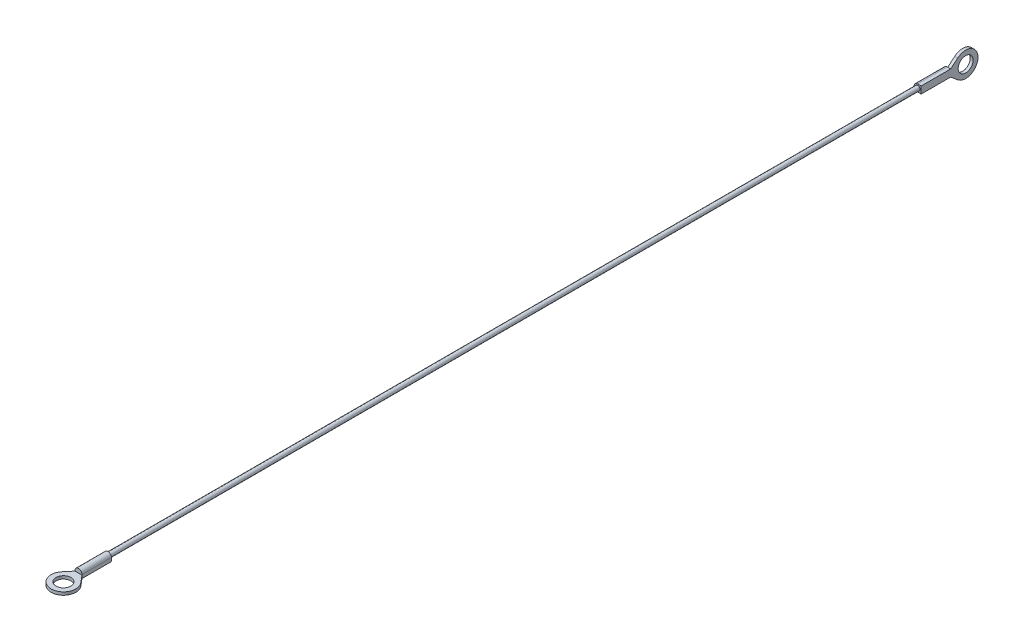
from build123d import *

# Parameters (mm, degrees)
SKETCH1_R           = 0.795
BOSS_EXTRUDE1_DEPTH = 137.32
BOSS_EXTRUDE2_DEPTH = 10
SKETCH3_R           = 2.54
BOSS_EXTRUDE3_DEPTH = 1.01
BOSS_EXTRUDE4_START = 10
BOSS_EXTRUDE4_DEPTH = 10
SKETCH5_R           = 2.54
BOSS_EXTRUDE5_DEPTH = 1.01


with BuildPart() as part:
    # Sketch1 → Boss-Extrude1 (new, symmetric)
    with BuildSketch(Plane.XY):
        Circle(SKETCH1_R)
    extrude(amount=BOSS_EXTRUDE1_DEPTH, both=True)

    # Sketch2 → Boss-Extrude2 (add)
    with BuildSketch(Plane.XY.offset(137.32)):
        with BuildLine():
            Line((-1.195, 0), (-1.195, -1.195))
            Line((-1.195, -1.195), (0, -1.195))
            Line((0, -1.195), (1.195, -1.195))
            Line((1.195, -1.195), (1.195, 0))
            ThreePointArc((1.195, 0), (0, 1.195), (-1.195, 0))
        make_face()
    extrude(amount=BOSS_EXTRUDE2_DEPTH)

    # Sketch3 → Boss-Extrude3 (add)
    with BuildSketch(Plane.XZ.offset(1.195)):
        with BuildLine():
            Line((1.195, 147.32), (3.201749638, 149.697242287))
            ThreePointArc((3.201749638, 149.697242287), (0, 156.59), (-3.201749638, 149.697242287))
            Line((-3.201749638, 149.697242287), (-1.195, 147.32))
            Line((-1.195, 147.32), (1.195, 147.32))
        make_face()
        with Locations(Location((0, 152.4, 0), (0, 0, 270))):
            Circle(SKETCH3_R, mode=Mode.SUBTRACT)
    extrude(amount=-BOSS_EXTRUDE3_DEPTH)

    # Sketch4 → Boss-Extrude4 (add)
    with BuildSketch(Plane(origin=(0, 0, -137.32), x_dir=(-1, 0, 0), z_dir=(0, 0, -1)).offset(BOSS_EXTRUDE4_START)):
        with BuildLine():
            Line((0, 1.195), (-1.195, 1.195))
            Line((-1.195, 1.195), (-1.195, 0))
            Line((-1.195, 0), (-1.195, -1.195))
            Line((-1.195, -1.195), (0, -1.195))
            ThreePointArc((0, -1.195), (1.195, 0), (0, 1.195))
        make_face()
    extrude(amount=-BOSS_EXTRUDE4_DEPTH)

    # Sketch5 → Boss-Extrude5 (add)
    with BuildSketch(Plane(origin=(1.195, 0, 0), x_dir=(0, 0, -1), z_dir=(1, 0, 0))):
        with BuildLine():
            Line((147.32, -1.195), (147.32, 1.195))
            Line((147.32, 1.195), (149.697242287, 3.201749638))
            ThreePointArc((149.697242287, 3.201749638), (156.59, 0), (149.697242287, -3.201749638))
            Line((149.697242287, -3.201749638), (147.32, -1.195))
        make_face()
        with Locations((152.4, 0)):
            Circle(SKETCH5_R, mode=Mode.SUBTRACT)
    extrude(amount=-BOSS_EXTRUDE5_DEPTH)


solid = part.part
